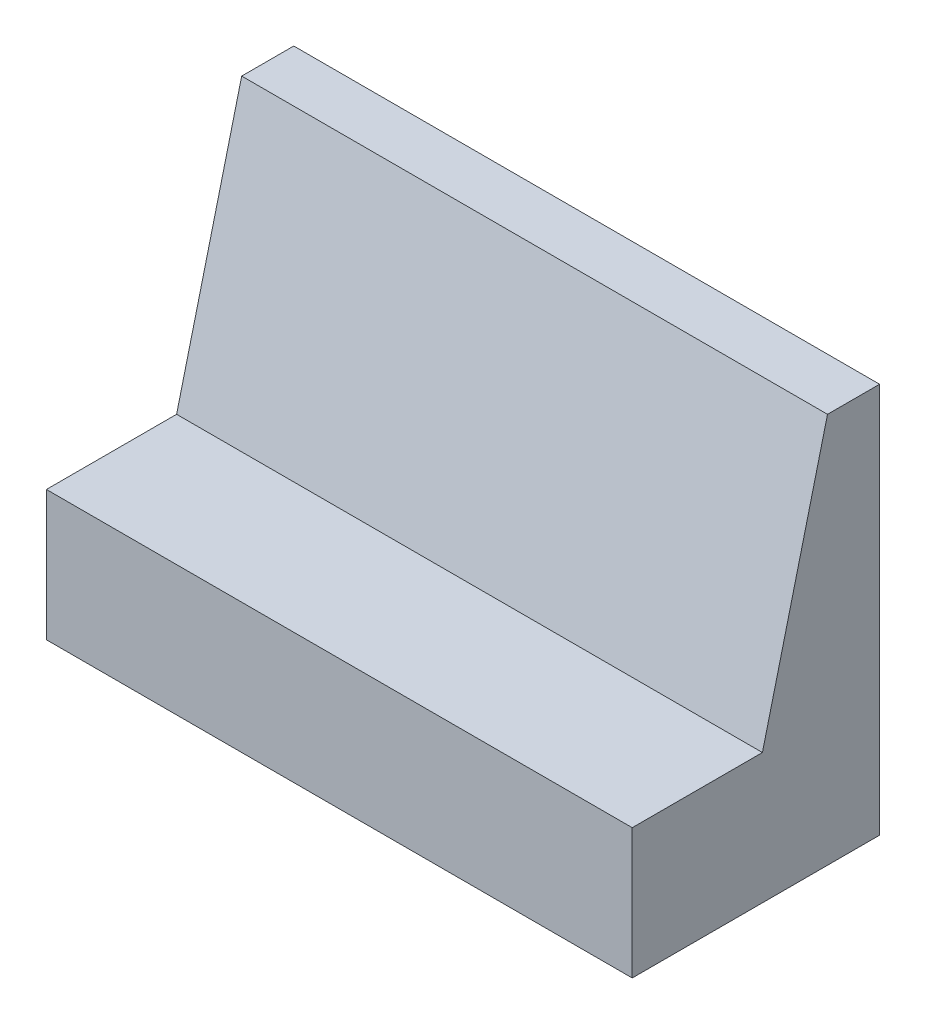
ISO-10303-21;
HEADER;
FILE_DESCRIPTION(('STEP AP214'),'2;1');
FILE_NAME('part.step','',(''),(''),'','','');
FILE_SCHEMA(('AUTOMOTIVE_DESIGN { 1 0 10303 214 1 1 1 1 }'));
ENDSEC;
DATA;
#1=APPLICATION_CONTEXT('core data for automotive mechanical design processes');
#2=APPLICATION_PROTOCOL_DEFINITION('international standard','automotive_design',2000,#1);
#3=PRODUCT_CONTEXT('',#1,'mechanical');
#4=PRODUCT('Part','Part','',(#3));
#5=PRODUCT_RELATED_PRODUCT_CATEGORY('part','',(#4));
#6=PRODUCT_DEFINITION_FORMATION('','',#4);
#7=PRODUCT_DEFINITION_CONTEXT('part definition',#1,'design');
#8=PRODUCT_DEFINITION('design','',#6,#7);
#9=PRODUCT_DEFINITION_SHAPE('','',#8);
#10=(LENGTH_UNIT() NAMED_UNIT(*) SI_UNIT(.MILLI.,.METRE.));
#11=(NAMED_UNIT(*) PLANE_ANGLE_UNIT() SI_UNIT($,.RADIAN.));
#12=(NAMED_UNIT(*) SI_UNIT($,.STERADIAN.) SOLID_ANGLE_UNIT());
#13=UNCERTAINTY_MEASURE_WITH_UNIT(LENGTH_MEASURE(1.E-05),#10,'distance_accuracy_value','');
#14=(GEOMETRIC_REPRESENTATION_CONTEXT(3) GLOBAL_UNCERTAINTY_ASSIGNED_CONTEXT((#13)) GLOBAL_UNIT_ASSIGNED_CONTEXT((#10,
#11,#12)) REPRESENTATION_CONTEXT('',''));
#15=CARTESIAN_POINT('',(0.,0.,0.));
#16=DIRECTION('',(0.,0.,1.));
#17=DIRECTION('',(1.,0.,0.));
#18=AXIS2_PLACEMENT_3D('',#15,#16,#17);
#19=CARTESIAN_POINT('',(-45.,0.,0.));
#20=DIRECTION('',(0.,0.,1.));
#21=DIRECTION('',(1.,0.,0.));
#22=AXIS2_PLACEMENT_3D('',#19,#20,#21);
#23=PLANE('',#22);
#24=DIRECTION('',(0.,-1.,0.));
#25=VECTOR('',#24,1.);
#26=CARTESIAN_POINT('',(0.,0.,0.));
#27=LINE('',#26,#25);
#28=CARTESIAN_POINT('',(0.,10.,0.));
#29=VERTEX_POINT('',#28);
#30=CARTESIAN_POINT('',(0.,0.,0.));
#31=VERTEX_POINT('',#30);
#32=EDGE_CURVE('E119',#29,#31,#27,.T.);
#33=ORIENTED_EDGE('',*,*,#32,.F.);
#34=DIRECTION('',(1.,0.,0.));
#35=VECTOR('',#34,1.);
#36=CARTESIAN_POINT('',(-45.,10.,0.));
#37=LINE('',#36,#35);
#38=CARTESIAN_POINT('',(-45.,10.,0.));
#39=VERTEX_POINT('',#38);
#40=EDGE_CURVE('E11',#39,#29,#37,.T.);
#41=ORIENTED_EDGE('',*,*,#40,.F.);
#42=DIRECTION('',(0.,-1.,0.));
#43=VECTOR('',#42,1.);
#44=CARTESIAN_POINT('',(-45.,0.,0.));
#45=LINE('',#44,#43);
#46=CARTESIAN_POINT('',(-45.,0.,0.));
#47=VERTEX_POINT('',#46);
#48=EDGE_CURVE('E134',#39,#47,#45,.T.);
#49=ORIENTED_EDGE('',*,*,#48,.T.);
#50=DIRECTION('',(1.,0.,0.));
#51=VECTOR('',#50,1.);
#52=CARTESIAN_POINT('',(-45.,0.,0.));
#53=LINE('',#52,#51);
#54=EDGE_CURVE('E37',#47,#31,#53,.T.);
#55=ORIENTED_EDGE('',*,*,#54,.T.);
#56=EDGE_LOOP('',(#33,#41,#49,#55));
#57=FACE_BOUND('',#56,.T.);
#58=ADVANCED_FACE('F34',(#57),#23,.T.);
#59=CARTESIAN_POINT('',(-45.,10.,0.));
#60=DIRECTION('',(0.,1.,0.));
#61=DIRECTION('',(0.,0.,1.));
#62=AXIS2_PLACEMENT_3D('',#59,#60,#61);
#63=PLANE('',#62);
#64=DIRECTION('',(0.,0.,1.));
#65=VECTOR('',#64,1.);
#66=CARTESIAN_POINT('',(0.,10.,0.));
#67=LINE('',#66,#65);
#68=CARTESIAN_POINT('',(0.,10.,-10.));
#69=VERTEX_POINT('',#68);
#70=EDGE_CURVE('E132',#69,#29,#67,.T.);
#71=ORIENTED_EDGE('',*,*,#70,.F.);
#72=DIRECTION('',(1.,0.,0.));
#73=VECTOR('',#72,1.);
#74=CARTESIAN_POINT('',(-45.,10.,-10.));
#75=LINE('',#74,#73);
#76=CARTESIAN_POINT('',(-45.,10.,-10.));
#77=VERTEX_POINT('',#76);
#78=EDGE_CURVE('E43',#77,#69,#75,.T.);
#79=ORIENTED_EDGE('',*,*,#78,.F.);
#80=DIRECTION('',(0.,0.,1.));
#81=VECTOR('',#80,1.);
#82=CARTESIAN_POINT('',(-45.,10.,0.));
#83=LINE('',#82,#81);
#84=EDGE_CURVE('E108',#77,#39,#83,.T.);
#85=ORIENTED_EDGE('',*,*,#84,.T.);
#86=ORIENTED_EDGE('',*,*,#40,.T.);
#87=EDGE_LOOP('',(#71,#79,#85,#86));
#88=FACE_BOUND('',#87,.T.);
#89=ADVANCED_FACE('F142',(#88),#63,.T.);
#90=CARTESIAN_POINT('',(-45.,30.,-15.));
#91=DIRECTION('',(0.,0.242535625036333,0.970142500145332));
#92=DIRECTION('',(0.,-0.970142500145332,0.242535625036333));
#93=AXIS2_PLACEMENT_3D('',#90,#91,#92);
#94=PLANE('',#93);
#95=DIRECTION('',(0.,-0.970142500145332,0.242535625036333));
#96=VECTOR('',#95,1.);
#97=CARTESIAN_POINT('',(0.,30.,-15.));
#98=LINE('',#97,#96);
#99=CARTESIAN_POINT('',(0.,30.,-15.));
#100=VERTEX_POINT('',#99);
#101=EDGE_CURVE('E96',#100,#69,#98,.T.);
#102=ORIENTED_EDGE('',*,*,#101,.F.);
#103=DIRECTION('',(1.,0.,0.));
#104=VECTOR('',#103,1.);
#105=CARTESIAN_POINT('',(-45.,30.,-15.));
#106=LINE('',#105,#104);
#107=CARTESIAN_POINT('',(-45.,30.,-15.));
#108=VERTEX_POINT('',#107);
#109=EDGE_CURVE('E91',#108,#100,#106,.T.);
#110=ORIENTED_EDGE('',*,*,#109,.F.);
#111=DIRECTION('',(0.,-0.970142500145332,0.242535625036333));
#112=VECTOR('',#111,1.);
#113=CARTESIAN_POINT('',(-45.,30.,-15.));
#114=LINE('',#113,#112);
#115=EDGE_CURVE('E94',#108,#77,#114,.T.);
#116=ORIENTED_EDGE('',*,*,#115,.T.);
#117=ORIENTED_EDGE('',*,*,#78,.T.);
#118=EDGE_LOOP('',(#102,#110,#116,#117));
#119=FACE_BOUND('',#118,.T.);
#120=ADVANCED_FACE('F93',(#119),#94,.T.);
#121=CARTESIAN_POINT('',(-45.,30.,-19.));
#122=DIRECTION('',(0.,1.,0.));
#123=DIRECTION('',(0.,0.,1.));
#124=AXIS2_PLACEMENT_3D('',#121,#122,#123);
#125=PLANE('',#124);
#126=DIRECTION('',(0.,0.,1.));
#127=VECTOR('',#126,1.);
#128=CARTESIAN_POINT('',(0.,30.,-19.));
#129=LINE('',#128,#127);
#130=CARTESIAN_POINT('',(0.,30.,-19.));
#131=VERTEX_POINT('',#130);
#132=EDGE_CURVE('E129',#131,#100,#129,.T.);
#133=ORIENTED_EDGE('',*,*,#132,.F.);
#134=DIRECTION('',(1.,0.,0.));
#135=VECTOR('',#134,1.);
#136=CARTESIAN_POINT('',(-45.,30.,-19.));
#137=LINE('',#136,#135);
#138=CARTESIAN_POINT('',(-45.,30.,-19.));
#139=VERTEX_POINT('',#138);
#140=EDGE_CURVE('E101',#139,#131,#137,.T.);
#141=ORIENTED_EDGE('',*,*,#140,.F.);
#142=DIRECTION('',(0.,0.,1.));
#143=VECTOR('',#142,1.);
#144=CARTESIAN_POINT('',(-45.,30.,-19.));
#145=LINE('',#144,#143);
#146=EDGE_CURVE('E107',#139,#108,#145,.T.);
#147=ORIENTED_EDGE('',*,*,#146,.T.);
#148=ORIENTED_EDGE('',*,*,#109,.T.);
#149=EDGE_LOOP('',(#133,#141,#147,#148));
#150=FACE_BOUND('',#149,.T.);
#151=ADVANCED_FACE('F111',(#150),#125,.T.);
#152=CARTESIAN_POINT('',(-45.,10.,-19.));
#153=DIRECTION('',(0.,0.,-1.));
#154=DIRECTION('',(0.,1.,0.));
#155=AXIS2_PLACEMENT_3D('',#152,#153,#154);
#156=PLANE('',#155);
#157=DIRECTION('',(0.,1.,0.));
#158=VECTOR('',#157,1.);
#159=CARTESIAN_POINT('',(0.,10.,-19.));
#160=LINE('',#159,#158);
#161=CARTESIAN_POINT('',(0.,0.,-19.));
#162=VERTEX_POINT('',#161);
#163=EDGE_CURVE('E126',#162,#131,#160,.T.);
#164=ORIENTED_EDGE('',*,*,#163,.F.);
#165=DIRECTION('',(1.,0.,0.));
#166=VECTOR('',#165,1.);
#167=CARTESIAN_POINT('',(-45.,0.,-19.));
#168=LINE('',#167,#166);
#169=CARTESIAN_POINT('',(-45.,0.,-19.));
#170=VERTEX_POINT('',#169);
#171=EDGE_CURVE('E137',#170,#162,#168,.T.);
#172=ORIENTED_EDGE('',*,*,#171,.F.);
#173=DIRECTION('',(0.,1.,0.));
#174=VECTOR('',#173,1.);
#175=CARTESIAN_POINT('',(-45.,0.,-19.));
#176=LINE('',#175,#174);
#177=EDGE_CURVE('E112',#170,#139,#176,.T.);
#178=ORIENTED_EDGE('',*,*,#177,.T.);
#179=ORIENTED_EDGE('',*,*,#140,.T.);
#180=EDGE_LOOP('',(#164,#172,#178,#179));
#181=FACE_BOUND('',#180,.T.);
#182=ADVANCED_FACE('F155',(#181),#156,.T.);
#183=CARTESIAN_POINT('',(-45.,0.,0.));
#184=DIRECTION('',(0.,-1.,0.));
#185=DIRECTION('',(0.,0.,-1.));
#186=AXIS2_PLACEMENT_3D('',#183,#184,#185);
#187=PLANE('',#186);
#188=CARTESIAN_POINT('',(-33.75,0.,-10.));
#189=DIRECTION('',(0.,-1.,0.));
#190=DIRECTION('',(0.,0.,-1.));
#191=AXIS2_PLACEMENT_3D('',#188,#189,#190);
#192=CIRCLE('',#191,4.);
#193=CARTESIAN_POINT('',(-33.75,0.,-14.));
#194=VERTEX_POINT('',#193);
#195=EDGE_CURVE('E166',#194,#194,#192,.T.);
#196=ORIENTED_EDGE('',*,*,#195,.F.);
#197=EDGE_LOOP('',(#196));
#198=FACE_BOUND('',#197,.T.);
#199=CARTESIAN_POINT('',(-11.25,0.,-10.));
#200=DIRECTION('',(0.,-1.,0.));
#201=DIRECTION('',(0.,0.,-1.));
#202=AXIS2_PLACEMENT_3D('',#199,#200,#201);
#203=CIRCLE('',#202,4.);
#204=CARTESIAN_POINT('',(-11.25,0.,-14.));
#205=VERTEX_POINT('',#204);
#206=EDGE_CURVE('E169',#205,#205,#203,.T.);
#207=ORIENTED_EDGE('',*,*,#206,.F.);
#208=EDGE_LOOP('',(#207));
#209=FACE_BOUND('',#208,.T.);
#210=DIRECTION('',(0.,0.,-1.));
#211=VECTOR('',#210,1.);
#212=CARTESIAN_POINT('',(0.,0.,0.));
#213=LINE('',#212,#211);
#214=EDGE_CURVE('E122',#31,#162,#213,.T.);
#215=ORIENTED_EDGE('',*,*,#214,.F.);
#216=ORIENTED_EDGE('',*,*,#54,.F.);
#217=DIRECTION('',(0.,0.,-1.));
#218=VECTOR('',#217,1.);
#219=CARTESIAN_POINT('',(-45.,0.,0.));
#220=LINE('',#219,#218);
#221=EDGE_CURVE('E114',#47,#170,#220,.T.);
#222=ORIENTED_EDGE('',*,*,#221,.T.);
#223=ORIENTED_EDGE('',*,*,#171,.T.);
#224=EDGE_LOOP('',(#215,#216,#222,#223));
#225=FACE_BOUND('',#224,.T.);
#226=ADVANCED_FACE('F139',(#198,#209,#225),#187,.T.);
#227=CARTESIAN_POINT('',(-45.,0.,0.));
#228=DIRECTION('',(-1.,0.,0.));
#229=DIRECTION('',(0.,0.,1.));
#230=AXIS2_PLACEMENT_3D('',#227,#228,#229);
#231=PLANE('',#230);
#232=ORIENTED_EDGE('',*,*,#48,.F.);
#233=ORIENTED_EDGE('',*,*,#84,.F.);
#234=ORIENTED_EDGE('',*,*,#115,.F.);
#235=ORIENTED_EDGE('',*,*,#146,.F.);
#236=ORIENTED_EDGE('',*,*,#177,.F.);
#237=ORIENTED_EDGE('',*,*,#221,.F.);
#238=EDGE_LOOP('',(#232,#233,#234,#235,#236,#237));
#239=FACE_BOUND('',#238,.T.);
#240=ADVANCED_FACE('F105',(#239),#231,.T.);
#241=CARTESIAN_POINT('',(0.,0.,0.));
#242=DIRECTION('',(-1.,0.,0.));
#243=DIRECTION('',(0.,0.,1.));
#244=AXIS2_PLACEMENT_3D('',#241,#242,#243);
#245=PLANE('',#244);
#246=ORIENTED_EDGE('',*,*,#32,.T.);
#247=ORIENTED_EDGE('',*,*,#214,.T.);
#248=ORIENTED_EDGE('',*,*,#163,.T.);
#249=ORIENTED_EDGE('',*,*,#132,.T.);
#250=ORIENTED_EDGE('',*,*,#101,.T.);
#251=ORIENTED_EDGE('',*,*,#70,.T.);
#252=EDGE_LOOP('',(#246,#247,#248,#249,#250,#251));
#253=FACE_BOUND('',#252,.T.);
#254=ADVANCED_FACE('F141',(#253),#245,.F.);
#255=CARTESIAN_POINT('',(-11.25,5.,-10.));
#256=DIRECTION('',(0.,-1.,0.));
#257=DIRECTION('',(0.,0.,-1.));
#258=AXIS2_PLACEMENT_3D('',#255,#256,#257);
#259=CYLINDRICAL_SURFACE('',#258,4.);
#260=CARTESIAN_POINT('',(-11.25,5.,-10.));
#261=DIRECTION('',(0.,-1.,0.));
#262=DIRECTION('',(0.,0.,-1.));
#263=AXIS2_PLACEMENT_3D('',#260,#261,#262);
#264=CIRCLE('',#263,4.);
#265=CARTESIAN_POINT('',(-11.25,5.,-14.));
#266=VERTEX_POINT('',#265);
#267=EDGE_CURVE('E171',#266,#266,#264,.T.);
#268=ORIENTED_EDGE('',*,*,#267,.F.);
#269=EDGE_LOOP('',(#268));
#270=FACE_BOUND('',#269,.T.);
#271=ORIENTED_EDGE('',*,*,#206,.T.);
#272=EDGE_LOOP('',(#271));
#273=FACE_BOUND('',#272,.T.);
#274=ADVANCED_FACE('F193',(#270,#273),#259,.F.);
#275=CARTESIAN_POINT('',(-11.25,5.,-10.));
#276=DIRECTION('',(0.,-1.,0.));
#277=DIRECTION('',(0.,0.,-1.));
#278=AXIS2_PLACEMENT_3D('',#275,#276,#277);
#279=PLANE('',#278);
#280=ORIENTED_EDGE('',*,*,#267,.T.);
#281=EDGE_LOOP('',(#280));
#282=FACE_BOUND('',#281,.T.);
#283=ADVANCED_FACE('F186',(#282),#279,.T.);
#284=CARTESIAN_POINT('',(-33.75,5.,-10.));
#285=DIRECTION('',(0.,-1.,0.));
#286=DIRECTION('',(0.,0.,-1.));
#287=AXIS2_PLACEMENT_3D('',#284,#285,#286);
#288=CYLINDRICAL_SURFACE('',#287,4.);
#289=CARTESIAN_POINT('',(-33.75,5.,-10.));
#290=DIRECTION('',(0.,-1.,0.));
#291=DIRECTION('',(0.,0.,-1.));
#292=AXIS2_PLACEMENT_3D('',#289,#290,#291);
#293=CIRCLE('',#292,4.);
#294=CARTESIAN_POINT('',(-33.75,5.,-14.));
#295=VERTEX_POINT('',#294);
#296=EDGE_CURVE('E123',#295,#295,#293,.T.);
#297=ORIENTED_EDGE('',*,*,#296,.F.);
#298=EDGE_LOOP('',(#297));
#299=FACE_BOUND('',#298,.T.);
#300=ORIENTED_EDGE('',*,*,#195,.T.);
#301=EDGE_LOOP('',(#300));
#302=FACE_BOUND('',#301,.T.);
#303=ADVANCED_FACE('F183',(#299,#302),#288,.F.);
#304=CARTESIAN_POINT('',(-33.75,5.,-10.));
#305=DIRECTION('',(0.,-1.,0.));
#306=DIRECTION('',(0.,0.,-1.));
#307=AXIS2_PLACEMENT_3D('',#304,#305,#306);
#308=PLANE('',#307);
#309=ORIENTED_EDGE('',*,*,#296,.T.);
#310=EDGE_LOOP('',(#309));
#311=FACE_BOUND('',#310,.T.);
#312=ADVANCED_FACE('F181',(#311),#308,.T.);
#313=CLOSED_SHELL('',(#58,#89,#120,#151,#182,#226,#240,#254,#274,#283,#303,#312));
#314=MANIFOLD_SOLID_BREP('B2',#313);
#315=ADVANCED_BREP_SHAPE_REPRESENTATION('',(#18,#314),#14);
#316=SHAPE_DEFINITION_REPRESENTATION(#9,#315);
ENDSEC;
END-ISO-10303-21;
